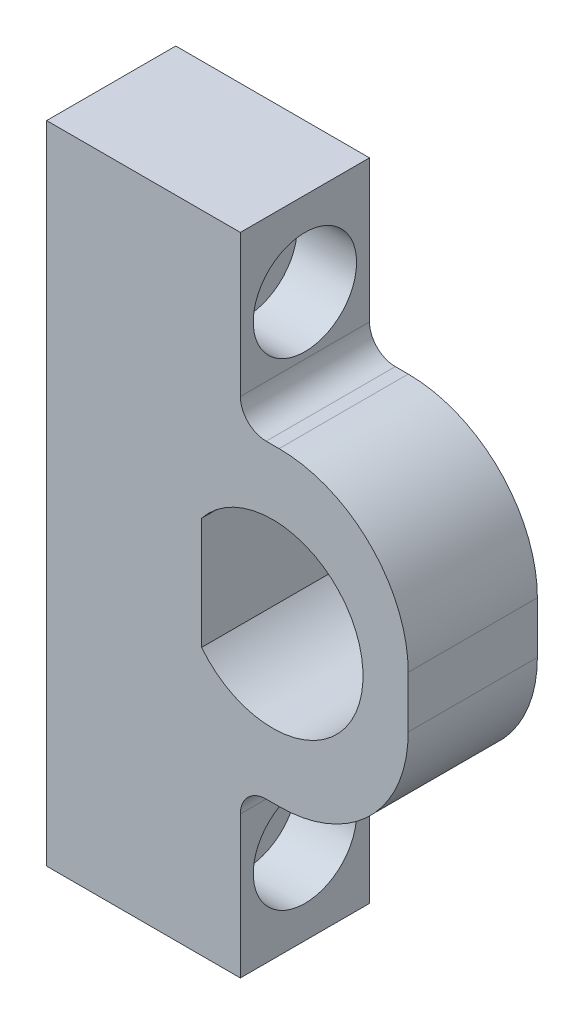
ISO-10303-21;
HEADER;
FILE_DESCRIPTION(('STEP AP214'),'2;1');
FILE_NAME('part.step','',(''),(''),'','','');
FILE_SCHEMA(('AUTOMOTIVE_DESIGN { 1 0 10303 214 1 1 1 1 }'));
ENDSEC;
DATA;
#1=APPLICATION_CONTEXT('core data for automotive mechanical design processes');
#2=APPLICATION_PROTOCOL_DEFINITION('international standard','automotive_design',2000,#1);
#3=PRODUCT_CONTEXT('',#1,'mechanical');
#4=PRODUCT('Part','Part','',(#3));
#5=PRODUCT_RELATED_PRODUCT_CATEGORY('part','',(#4));
#6=PRODUCT_DEFINITION_FORMATION('','',#4);
#7=PRODUCT_DEFINITION_CONTEXT('part definition',#1,'design');
#8=PRODUCT_DEFINITION('design','',#6,#7);
#9=PRODUCT_DEFINITION_SHAPE('','',#8);
#10=(LENGTH_UNIT() NAMED_UNIT(*) SI_UNIT(.MILLI.,.METRE.));
#11=(NAMED_UNIT(*) PLANE_ANGLE_UNIT() SI_UNIT($,.RADIAN.));
#12=(NAMED_UNIT(*) SI_UNIT($,.STERADIAN.) SOLID_ANGLE_UNIT());
#13=UNCERTAINTY_MEASURE_WITH_UNIT(LENGTH_MEASURE(1.E-05),#10,'distance_accuracy_value','');
#14=(GEOMETRIC_REPRESENTATION_CONTEXT(3) GLOBAL_UNCERTAINTY_ASSIGNED_CONTEXT((#13)) GLOBAL_UNIT_ASSIGNED_CONTEXT((#10,
#11,#12)) REPRESENTATION_CONTEXT('',''));
#15=CARTESIAN_POINT('',(0.,0.,0.));
#16=DIRECTION('',(0.,0.,1.));
#17=DIRECTION('',(1.,0.,0.));
#18=AXIS2_PLACEMENT_3D('',#15,#16,#17);
#19=CARTESIAN_POINT('',(14.,25.,10.));
#20=DIRECTION('',(-1.,0.,0.));
#21=DIRECTION('',(0.,-1.,0.));
#22=AXIS2_PLACEMENT_3D('',#19,#20,#21);
#23=PLANE('',#22);
#24=DIRECTION('',(0.,1.,0.));
#25=VECTOR('',#24,1.);
#26=CARTESIAN_POINT('',(14.,25.,10.));
#27=LINE('',#26,#25);
#28=CARTESIAN_POINT('',(14.,-2.,10.));
#29=VERTEX_POINT('',#28);
#30=CARTESIAN_POINT('',(14.,2.,10.));
#31=VERTEX_POINT('',#30);
#32=EDGE_CURVE('E175',#29,#31,#27,.T.);
#33=ORIENTED_EDGE('',*,*,#32,.F.);
#34=DIRECTION('',(0.,0.,-1.));
#35=VECTOR('',#34,1.);
#36=CARTESIAN_POINT('',(14.,-2.,10.));
#37=LINE('',#36,#35);
#38=CARTESIAN_POINT('',(14.,-2.,0.));
#39=VERTEX_POINT('',#38);
#40=EDGE_CURVE('E207',#29,#39,#37,.T.);
#41=ORIENTED_EDGE('',*,*,#40,.T.);
#42=DIRECTION('',(0.,1.,0.));
#43=VECTOR('',#42,1.);
#44=CARTESIAN_POINT('',(14.,25.,0.));
#45=LINE('',#44,#43);
#46=CARTESIAN_POINT('',(14.,2.,0.));
#47=VERTEX_POINT('',#46);
#48=EDGE_CURVE('E174',#39,#47,#45,.T.);
#49=ORIENTED_EDGE('',*,*,#48,.T.);
#50=DIRECTION('',(0.,0.,1.));
#51=VECTOR('',#50,1.);
#52=CARTESIAN_POINT('',(14.,2.,10.));
#53=LINE('',#52,#51);
#54=EDGE_CURVE('E204',#47,#31,#53,.T.);
#55=ORIENTED_EDGE('',*,*,#54,.T.);
#56=EDGE_LOOP('',(#33,#41,#49,#55));
#57=FACE_BOUND('',#56,.T.);
#58=ADVANCED_FACE('F16',(#57),#23,.F.);
#59=CARTESIAN_POINT('',(-14.,25.,10.));
#60=DIRECTION('',(0.,-1.,0.));
#61=DIRECTION('',(0.,0.,-1.));
#62=AXIS2_PLACEMENT_3D('',#59,#60,#61);
#63=PLANE('',#62);
#64=DIRECTION('',(-1.,0.,0.));
#65=VECTOR('',#64,1.);
#66=CARTESIAN_POINT('',(-14.,25.,10.));
#67=LINE('',#66,#65);
#68=CARTESIAN_POINT('',(1.,25.,10.));
#69=VERTEX_POINT('',#68);
#70=CARTESIAN_POINT('',(-14.,25.,10.));
#71=VERTEX_POINT('',#70);
#72=EDGE_CURVE('E178',#69,#71,#67,.T.);
#73=ORIENTED_EDGE('',*,*,#72,.F.);
#74=DIRECTION('',(0.,0.,-1.));
#75=VECTOR('',#74,1.);
#76=CARTESIAN_POINT('',(1.,25.,10.));
#77=LINE('',#76,#75);
#78=CARTESIAN_POINT('',(1.,25.,0.));
#79=VERTEX_POINT('',#78);
#80=EDGE_CURVE('E160',#69,#79,#77,.T.);
#81=ORIENTED_EDGE('',*,*,#80,.T.);
#82=DIRECTION('',(-1.,0.,0.));
#83=VECTOR('',#82,1.);
#84=CARTESIAN_POINT('',(-14.,25.,0.));
#85=LINE('',#84,#83);
#86=CARTESIAN_POINT('',(-14.,25.,0.));
#87=VERTEX_POINT('',#86);
#88=EDGE_CURVE('E189',#79,#87,#85,.T.);
#89=ORIENTED_EDGE('',*,*,#88,.T.);
#90=DIRECTION('',(0.,0.,-1.));
#91=VECTOR('',#90,1.);
#92=CARTESIAN_POINT('',(-14.,25.,10.));
#93=LINE('',#92,#91);
#94=EDGE_CURVE('E197',#71,#87,#93,.T.);
#95=ORIENTED_EDGE('',*,*,#94,.F.);
#96=EDGE_LOOP('',(#73,#81,#89,#95));
#97=FACE_BOUND('',#96,.T.);
#98=ADVANCED_FACE('F295',(#97),#63,.F.);
#99=CARTESIAN_POINT('',(-14.,25.,10.));
#100=DIRECTION('',(1.,0.,0.));
#101=DIRECTION('',(0.,1.,0.));
#102=AXIS2_PLACEMENT_3D('',#99,#100,#101);
#103=PLANE('',#102);
#104=CARTESIAN_POINT('',(-14.0000000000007,18.5,5.));
#105=DIRECTION('',(1.,0.,0.));
#106=DIRECTION('',(0.,0.,-1.));
#107=AXIS2_PLACEMENT_3D('',#104,#105,#106);
#108=CIRCLE('',#107,2.25);
#109=CARTESIAN_POINT('',(-14.0000000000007,18.5,2.75));
#110=VERTEX_POINT('',#109);
#111=EDGE_CURVE('E139',#110,#110,#108,.T.);
#112=ORIENTED_EDGE('',*,*,#111,.T.);
#113=EDGE_LOOP('',(#112));
#114=FACE_BOUND('',#113,.T.);
#115=CARTESIAN_POINT('',(-14.0000000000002,-18.5,5.));
#116=DIRECTION('',(1.,0.,0.));
#117=DIRECTION('',(0.,0.,-1.));
#118=AXIS2_PLACEMENT_3D('',#115,#116,#117);
#119=CIRCLE('',#118,2.25);
#120=CARTESIAN_POINT('',(-14.0000000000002,-18.5,2.75));
#121=VERTEX_POINT('',#120);
#122=EDGE_CURVE('E151',#121,#121,#119,.T.);
#123=ORIENTED_EDGE('',*,*,#122,.T.);
#124=EDGE_LOOP('',(#123));
#125=FACE_BOUND('',#124,.T.);
#126=DIRECTION('',(0.,-1.,0.));
#127=VECTOR('',#126,1.);
#128=CARTESIAN_POINT('',(-14.,25.,0.));
#129=LINE('',#128,#127);
#130=CARTESIAN_POINT('',(-14.,-25.,0.));
#131=VERTEX_POINT('',#130);
#132=EDGE_CURVE('E191',#87,#131,#129,.T.);
#133=ORIENTED_EDGE('',*,*,#132,.T.);
#134=DIRECTION('',(0.,0.,-1.));
#135=VECTOR('',#134,1.);
#136=CARTESIAN_POINT('',(-14.,-25.,10.));
#137=LINE('',#136,#135);
#138=CARTESIAN_POINT('',(-14.,-25.,10.));
#139=VERTEX_POINT('',#138);
#140=EDGE_CURVE('E186',#139,#131,#137,.T.);
#141=ORIENTED_EDGE('',*,*,#140,.F.);
#142=DIRECTION('',(0.,-1.,0.));
#143=VECTOR('',#142,1.);
#144=CARTESIAN_POINT('',(-14.,25.,10.));
#145=LINE('',#144,#143);
#146=EDGE_CURVE('E181',#71,#139,#145,.T.);
#147=ORIENTED_EDGE('',*,*,#146,.F.);
#148=ORIENTED_EDGE('',*,*,#94,.T.);
#149=EDGE_LOOP('',(#133,#141,#147,#148));
#150=FACE_BOUND('',#149,.T.);
#151=ADVANCED_FACE('F292',(#114,#125,#150),#103,.F.);
#152=CARTESIAN_POINT('',(-14.,-25.,10.));
#153=DIRECTION('',(0.,1.,0.));
#154=DIRECTION('',(0.,0.,1.));
#155=AXIS2_PLACEMENT_3D('',#152,#153,#154);
#156=PLANE('',#155);
#157=DIRECTION('',(1.,0.,0.));
#158=VECTOR('',#157,1.);
#159=CARTESIAN_POINT('',(-14.,-25.,0.));
#160=LINE('',#159,#158);
#161=CARTESIAN_POINT('',(1.,-25.,0.));
#162=VERTEX_POINT('',#161);
#163=EDGE_CURVE('E179',#131,#162,#160,.T.);
#164=ORIENTED_EDGE('',*,*,#163,.T.);
#165=DIRECTION('',(0.,0.,1.));
#166=VECTOR('',#165,1.);
#167=CARTESIAN_POINT('',(1.,-25.,10.));
#168=LINE('',#167,#166);
#169=CARTESIAN_POINT('',(1.,-25.,10.));
#170=VERTEX_POINT('',#169);
#171=EDGE_CURVE('E170',#162,#170,#168,.T.);
#172=ORIENTED_EDGE('',*,*,#171,.T.);
#173=DIRECTION('',(1.,0.,0.));
#174=VECTOR('',#173,1.);
#175=CARTESIAN_POINT('',(-14.,-25.,10.));
#176=LINE('',#175,#174);
#177=EDGE_CURVE('E183',#139,#170,#176,.T.);
#178=ORIENTED_EDGE('',*,*,#177,.F.);
#179=ORIENTED_EDGE('',*,*,#140,.T.);
#180=EDGE_LOOP('',(#164,#172,#178,#179));
#181=FACE_BOUND('',#180,.T.);
#182=ADVANCED_FACE('F288',(#181),#156,.F.);
#183=CARTESIAN_POINT('',(0.,0.,10.));
#184=DIRECTION('',(0.,0.,1.));
#185=DIRECTION('',(1.,0.,0.));
#186=AXIS2_PLACEMENT_3D('',#183,#184,#185);
#187=PLANE('',#186);
#188=CARTESIAN_POINT('',(3.5,0.,10.));
#189=DIRECTION('',(0.,0.,1.));
#190=DIRECTION('',(1.,0.,0.));
#191=AXIS2_PLACEMENT_3D('',#188,#189,#190);
#192=CIRCLE('',#191,7.);
#193=CARTESIAN_POINT('',(-2.,-4.3301270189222,10.));
#194=VERTEX_POINT('',#193);
#195=CARTESIAN_POINT('',(-2.,4.3301270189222,10.));
#196=VERTEX_POINT('',#195);
#197=EDGE_CURVE('E30',#194,#196,#192,.T.);
#198=ORIENTED_EDGE('',*,*,#197,.F.);
#199=DIRECTION('',(0.,1.,0.));
#200=VECTOR('',#199,1.);
#201=CARTESIAN_POINT('',(-2.,-5.,10.));
#202=LINE('',#201,#200);
#203=EDGE_CURVE('E117',#194,#196,#202,.T.);
#204=ORIENTED_EDGE('',*,*,#203,.T.);
#205=EDGE_LOOP('',(#198,#204));
#206=FACE_BOUND('',#205,.T.);
#207=DIRECTION('',(0.,1.,0.));
#208=VECTOR('',#207,1.);
#209=CARTESIAN_POINT('',(1.,-38.,10.));
#210=LINE('',#209,#208);
#211=CARTESIAN_POINT('',(1.,-14.,10.));
#212=VERTEX_POINT('',#211);
#213=EDGE_CURVE('E165',#170,#212,#210,.T.);
#214=ORIENTED_EDGE('',*,*,#213,.T.);
#215=CARTESIAN_POINT('',(3.,-14.,10.));
#216=DIRECTION('',(0.,0.,1.));
#217=DIRECTION('',(1.,0.,0.));
#218=AXIS2_PLACEMENT_3D('',#215,#216,#217);
#219=CIRCLE('',#218,2.);
#220=CARTESIAN_POINT('',(3.,-12.,10.));
#221=VERTEX_POINT('',#220);
#222=EDGE_CURVE('E237',#212,#221,#219,.F.);
#223=ORIENTED_EDGE('',*,*,#222,.T.);
#224=DIRECTION('',(1.,0.,0.));
#225=VECTOR('',#224,1.);
#226=CARTESIAN_POINT('',(27.,-12.,10.));
#227=LINE('',#226,#225);
#228=CARTESIAN_POINT('',(4.,-12.,10.));
#229=VERTEX_POINT('',#228);
#230=EDGE_CURVE('E168',#221,#229,#227,.T.);
#231=ORIENTED_EDGE('',*,*,#230,.T.);
#232=CARTESIAN_POINT('',(4.,-2.,10.));
#233=DIRECTION('',(0.,0.,1.));
#234=DIRECTION('',(1.,0.,0.));
#235=AXIS2_PLACEMENT_3D('',#232,#233,#234);
#236=CIRCLE('',#235,10.);
#237=EDGE_CURVE('E220',#229,#29,#236,.T.);
#238=ORIENTED_EDGE('',*,*,#237,.T.);
#239=ORIENTED_EDGE('',*,*,#32,.T.);
#240=CARTESIAN_POINT('',(4.,2.,10.));
#241=DIRECTION('',(0.,0.,1.));
#242=DIRECTION('',(1.,0.,0.));
#243=AXIS2_PLACEMENT_3D('',#240,#241,#242);
#244=CIRCLE('',#243,10.);
#245=CARTESIAN_POINT('',(4.,12.,10.));
#246=VERTEX_POINT('',#245);
#247=EDGE_CURVE('E218',#31,#246,#244,.T.);
#248=ORIENTED_EDGE('',*,*,#247,.T.);
#249=DIRECTION('',(-1.,0.,0.));
#250=VECTOR('',#249,1.);
#251=CARTESIAN_POINT('',(27.,12.,10.));
#252=LINE('',#251,#250);
#253=CARTESIAN_POINT('',(3.,12.,10.));
#254=VERTEX_POINT('',#253);
#255=EDGE_CURVE('E155',#246,#254,#252,.T.);
#256=ORIENTED_EDGE('',*,*,#255,.T.);
#257=CARTESIAN_POINT('',(3.,14.,10.));
#258=DIRECTION('',(0.,0.,1.));
#259=DIRECTION('',(1.,0.,0.));
#260=AXIS2_PLACEMENT_3D('',#257,#258,#259);
#261=CIRCLE('',#260,2.);
#262=CARTESIAN_POINT('',(1.,14.,10.));
#263=VERTEX_POINT('',#262);
#264=EDGE_CURVE('E124',#254,#263,#261,.F.);
#265=ORIENTED_EDGE('',*,*,#264,.T.);
#266=DIRECTION('',(0.,1.,0.));
#267=VECTOR('',#266,1.);
#268=CARTESIAN_POINT('',(1.,38.,10.));
#269=LINE('',#268,#267);
#270=EDGE_CURVE('E158',#263,#69,#269,.T.);
#271=ORIENTED_EDGE('',*,*,#270,.T.);
#272=ORIENTED_EDGE('',*,*,#72,.T.);
#273=ORIENTED_EDGE('',*,*,#146,.T.);
#274=ORIENTED_EDGE('',*,*,#177,.T.);
#275=EDGE_LOOP('',(#214,#223,#231,#238,#239,#248,#256,#265,#271,#272,#273,#274));
#276=FACE_BOUND('',#275,.T.);
#277=ADVANCED_FACE('F114',(#206,#276),#187,.T.);
#278=CARTESIAN_POINT('',(0.,0.,0.));
#279=DIRECTION('',(0.,0.,1.));
#280=DIRECTION('',(1.,0.,0.));
#281=AXIS2_PLACEMENT_3D('',#278,#279,#280);
#282=PLANE('',#281);
#283=DIRECTION('',(0.,1.,0.));
#284=VECTOR('',#283,1.);
#285=CARTESIAN_POINT('',(-2.,-5.,0.));
#286=LINE('',#285,#284);
#287=CARTESIAN_POINT('',(-2.,-4.3301270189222,0.));
#288=VERTEX_POINT('',#287);
#289=CARTESIAN_POINT('',(-2.,4.3301270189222,0.));
#290=VERTEX_POINT('',#289);
#291=EDGE_CURVE('E118',#288,#290,#286,.T.);
#292=ORIENTED_EDGE('',*,*,#291,.F.);
#293=CARTESIAN_POINT('',(3.5,0.,0.));
#294=DIRECTION('',(0.,0.,1.));
#295=DIRECTION('',(1.,0.,0.));
#296=AXIS2_PLACEMENT_3D('',#293,#294,#295);
#297=CIRCLE('',#296,7.);
#298=EDGE_CURVE('E35',#288,#290,#297,.T.);
#299=ORIENTED_EDGE('',*,*,#298,.T.);
#300=EDGE_LOOP('',(#292,#299));
#301=FACE_BOUND('',#300,.T.);
#302=ORIENTED_EDGE('',*,*,#48,.F.);
#303=CARTESIAN_POINT('',(4.,-2.,0.));
#304=DIRECTION('',(0.,0.,1.));
#305=DIRECTION('',(1.,0.,0.));
#306=AXIS2_PLACEMENT_3D('',#303,#304,#305);
#307=CIRCLE('',#306,10.);
#308=CARTESIAN_POINT('',(4.,-12.,0.));
#309=VERTEX_POINT('',#308);
#310=EDGE_CURVE('E212',#39,#309,#307,.F.);
#311=ORIENTED_EDGE('',*,*,#310,.T.);
#312=DIRECTION('',(1.,0.,0.));
#313=VECTOR('',#312,1.);
#314=CARTESIAN_POINT('',(27.,-12.,0.));
#315=LINE('',#314,#313);
#316=CARTESIAN_POINT('',(3.,-12.,0.));
#317=VERTEX_POINT('',#316);
#318=EDGE_CURVE('E164',#317,#309,#315,.T.);
#319=ORIENTED_EDGE('',*,*,#318,.F.);
#320=CARTESIAN_POINT('',(3.,-14.,0.));
#321=DIRECTION('',(0.,0.,1.));
#322=DIRECTION('',(1.,0.,0.));
#323=AXIS2_PLACEMENT_3D('',#320,#321,#322);
#324=CIRCLE('',#323,2.);
#325=CARTESIAN_POINT('',(1.,-14.,0.));
#326=VERTEX_POINT('',#325);
#327=EDGE_CURVE('E235',#317,#326,#324,.T.);
#328=ORIENTED_EDGE('',*,*,#327,.T.);
#329=DIRECTION('',(0.,-1.,0.));
#330=VECTOR('',#329,1.);
#331=CARTESIAN_POINT('',(1.,0.,0.));
#332=LINE('',#331,#330);
#333=EDGE_CURVE('E200',#326,#162,#332,.T.);
#334=ORIENTED_EDGE('',*,*,#333,.T.);
#335=ORIENTED_EDGE('',*,*,#163,.F.);
#336=ORIENTED_EDGE('',*,*,#132,.F.);
#337=ORIENTED_EDGE('',*,*,#88,.F.);
#338=DIRECTION('',(0.,1.,0.));
#339=VECTOR('',#338,1.);
#340=CARTESIAN_POINT('',(1.,38.,0.));
#341=LINE('',#340,#339);
#342=CARTESIAN_POINT('',(1.,14.,0.));
#343=VERTEX_POINT('',#342);
#344=EDGE_CURVE('E154',#343,#79,#341,.T.);
#345=ORIENTED_EDGE('',*,*,#344,.F.);
#346=CARTESIAN_POINT('',(3.,14.,0.));
#347=DIRECTION('',(0.,0.,1.));
#348=DIRECTION('',(1.,0.,0.));
#349=AXIS2_PLACEMENT_3D('',#346,#347,#348);
#350=CIRCLE('',#349,2.);
#351=CARTESIAN_POINT('',(3.,12.,0.));
#352=VERTEX_POINT('',#351);
#353=EDGE_CURVE('E239',#343,#352,#350,.T.);
#354=ORIENTED_EDGE('',*,*,#353,.T.);
#355=DIRECTION('',(1.,0.,0.));
#356=VECTOR('',#355,1.);
#357=CARTESIAN_POINT('',(0.,12.,0.));
#358=LINE('',#357,#356);
#359=CARTESIAN_POINT('',(4.,12.,0.));
#360=VERTEX_POINT('',#359);
#361=EDGE_CURVE('E202',#352,#360,#358,.T.);
#362=ORIENTED_EDGE('',*,*,#361,.T.);
#363=CARTESIAN_POINT('',(4.,2.,0.));
#364=DIRECTION('',(0.,0.,1.));
#365=DIRECTION('',(1.,0.,0.));
#366=AXIS2_PLACEMENT_3D('',#363,#364,#365);
#367=CIRCLE('',#366,10.);
#368=EDGE_CURVE('E210',#360,#47,#367,.F.);
#369=ORIENTED_EDGE('',*,*,#368,.T.);
#370=EDGE_LOOP('',(#302,#311,#319,#328,#334,#335,#336,#337,#345,#354,#362,#369));
#371=FACE_BOUND('',#370,.T.);
#372=ADVANCED_FACE('F255',(#301,#371),#282,.F.);
#373=CARTESIAN_POINT('',(1.,-38.,10.));
#374=DIRECTION('',(-1.,0.,0.));
#375=DIRECTION('',(0.,0.,1.));
#376=AXIS2_PLACEMENT_3D('',#373,#374,#375);
#377=PLANE('',#376);
#378=CARTESIAN_POINT('',(1.00000000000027,-18.5,5.));
#379=DIRECTION('',(1.,0.,0.));
#380=DIRECTION('',(0.,0.,-1.));
#381=AXIS2_PLACEMENT_3D('',#378,#379,#380);
#382=CIRCLE('',#381,4.);
#383=CARTESIAN_POINT('',(1.00000000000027,-18.5,1.));
#384=VERTEX_POINT('',#383);
#385=EDGE_CURVE('E142',#384,#384,#382,.T.);
#386=ORIENTED_EDGE('',*,*,#385,.F.);
#387=EDGE_LOOP('',(#386));
#388=FACE_BOUND('',#387,.T.);
#389=ORIENTED_EDGE('',*,*,#333,.F.);
#390=DIRECTION('',(0.,0.,-1.));
#391=VECTOR('',#390,1.);
#392=CARTESIAN_POINT('',(1.,-14.,10.));
#393=LINE('',#392,#391);
#394=EDGE_CURVE('E228',#326,#212,#393,.F.);
#395=ORIENTED_EDGE('',*,*,#394,.T.);
#396=ORIENTED_EDGE('',*,*,#213,.F.);
#397=ORIENTED_EDGE('',*,*,#171,.F.);
#398=EDGE_LOOP('',(#389,#395,#396,#397));
#399=FACE_BOUND('',#398,.T.);
#400=ADVANCED_FACE('F282',(#388,#399),#377,.F.);
#401=CARTESIAN_POINT('',(27.,-12.,10.));
#402=DIRECTION('',(0.,1.,0.));
#403=DIRECTION('',(0.,0.,1.));
#404=AXIS2_PLACEMENT_3D('',#401,#402,#403);
#405=PLANE('',#404);
#406=ORIENTED_EDGE('',*,*,#230,.F.);
#407=DIRECTION('',(0.,0.,-1.));
#408=VECTOR('',#407,1.);
#409=CARTESIAN_POINT('',(3.,-12.,0.));
#410=LINE('',#409,#408);
#411=EDGE_CURVE('E225',#221,#317,#410,.T.);
#412=ORIENTED_EDGE('',*,*,#411,.T.);
#413=ORIENTED_EDGE('',*,*,#318,.T.);
#414=DIRECTION('',(0.,0.,-1.));
#415=VECTOR('',#414,1.);
#416=CARTESIAN_POINT('',(4.,-12.,10.));
#417=LINE('',#416,#415);
#418=EDGE_CURVE('E215',#309,#229,#417,.F.);
#419=ORIENTED_EDGE('',*,*,#418,.T.);
#420=EDGE_LOOP('',(#406,#412,#413,#419));
#421=FACE_BOUND('',#420,.T.);
#422=ADVANCED_FACE('F275',(#421),#405,.F.);
#423=CARTESIAN_POINT('',(1.,38.,10.));
#424=DIRECTION('',(-1.,0.,0.));
#425=DIRECTION('',(0.,0.,1.));
#426=AXIS2_PLACEMENT_3D('',#423,#424,#425);
#427=PLANE('',#426);
#428=CARTESIAN_POINT('',(0.999999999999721,18.5,5.));
#429=DIRECTION('',(1.,0.,0.));
#430=DIRECTION('',(0.,0.,-1.));
#431=AXIS2_PLACEMENT_3D('',#428,#429,#430);
#432=CIRCLE('',#431,4.);
#433=CARTESIAN_POINT('',(0.999999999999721,18.5,1.));
#434=VERTEX_POINT('',#433);
#435=EDGE_CURVE('E130',#434,#434,#432,.T.);
#436=ORIENTED_EDGE('',*,*,#435,.F.);
#437=EDGE_LOOP('',(#436));
#438=FACE_BOUND('',#437,.T.);
#439=ORIENTED_EDGE('',*,*,#270,.F.);
#440=DIRECTION('',(0.,0.,-1.));
#441=VECTOR('',#440,1.);
#442=CARTESIAN_POINT('',(1.,14.,0.));
#443=LINE('',#442,#441);
#444=EDGE_CURVE('E230',#263,#343,#443,.T.);
#445=ORIENTED_EDGE('',*,*,#444,.T.);
#446=ORIENTED_EDGE('',*,*,#344,.T.);
#447=ORIENTED_EDGE('',*,*,#80,.F.);
#448=EDGE_LOOP('',(#439,#445,#446,#447));
#449=FACE_BOUND('',#448,.T.);
#450=ADVANCED_FACE('F249',(#438,#449),#427,.F.);
#451=CARTESIAN_POINT('',(27.,12.,10.));
#452=DIRECTION('',(0.,-1.,0.));
#453=DIRECTION('',(0.,0.,-1.));
#454=AXIS2_PLACEMENT_3D('',#451,#452,#453);
#455=PLANE('',#454);
#456=ORIENTED_EDGE('',*,*,#361,.F.);
#457=DIRECTION('',(0.,0.,-1.));
#458=VECTOR('',#457,1.);
#459=CARTESIAN_POINT('',(3.,12.,10.));
#460=LINE('',#459,#458);
#461=EDGE_CURVE('E233',#352,#254,#460,.F.);
#462=ORIENTED_EDGE('',*,*,#461,.T.);
#463=ORIENTED_EDGE('',*,*,#255,.F.);
#464=DIRECTION('',(0.,0.,1.));
#465=VECTOR('',#464,1.);
#466=CARTESIAN_POINT('',(4.,12.,10.));
#467=LINE('',#466,#465);
#468=EDGE_CURVE('E222',#246,#360,#467,.F.);
#469=ORIENTED_EDGE('',*,*,#468,.T.);
#470=EDGE_LOOP('',(#456,#462,#463,#469));
#471=FACE_BOUND('',#470,.T.);
#472=ADVANCED_FACE('F258',(#471),#455,.F.);
#473=CARTESIAN_POINT('',(1.00000000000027,-18.5,5.));
#474=DIRECTION('',(1.,0.,0.));
#475=DIRECTION('',(0.,0.,-1.));
#476=AXIS2_PLACEMENT_3D('',#473,#474,#475);
#477=CYLINDRICAL_SURFACE('',#476,2.25);
#478=ORIENTED_EDGE('',*,*,#122,.F.);
#479=EDGE_LOOP('',(#478));
#480=FACE_BOUND('',#479,.T.);
#481=CARTESIAN_POINT('',(-3.59999999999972,-18.5,5.));
#482=DIRECTION('',(1.,0.,0.));
#483=DIRECTION('',(0.,0.,-1.));
#484=AXIS2_PLACEMENT_3D('',#481,#482,#483);
#485=CIRCLE('',#484,2.25);
#486=CARTESIAN_POINT('',(-3.59999999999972,-18.5,2.75));
#487=VERTEX_POINT('',#486);
#488=EDGE_CURVE('E148',#487,#487,#485,.T.);
#489=ORIENTED_EDGE('',*,*,#488,.T.);
#490=EDGE_LOOP('',(#489));
#491=FACE_BOUND('',#490,.T.);
#492=ADVANCED_FACE('F347',(#480,#491),#477,.F.);
#493=CARTESIAN_POINT('',(-3.59999999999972,-16.25,5.));
#494=DIRECTION('',(-1.,0.,0.));
#495=DIRECTION('',(0.,0.,1.));
#496=AXIS2_PLACEMENT_3D('',#493,#494,#495);
#497=PLANE('',#496);
#498=ORIENTED_EDGE('',*,*,#488,.F.);
#499=EDGE_LOOP('',(#498));
#500=FACE_BOUND('',#499,.T.);
#501=CARTESIAN_POINT('',(-3.59999999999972,-18.5,5.));
#502=DIRECTION('',(1.,0.,0.));
#503=DIRECTION('',(0.,0.,-1.));
#504=AXIS2_PLACEMENT_3D('',#501,#502,#503);
#505=CIRCLE('',#504,4.);
#506=CARTESIAN_POINT('',(-3.59999999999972,-18.5,1.));
#507=VERTEX_POINT('',#506);
#508=EDGE_CURVE('E145',#507,#507,#505,.T.);
#509=ORIENTED_EDGE('',*,*,#508,.T.);
#510=EDGE_LOOP('',(#509));
#511=FACE_BOUND('',#510,.T.);
#512=ADVANCED_FACE('F343',(#500,#511),#497,.F.);
#513=CARTESIAN_POINT('',(1.00000000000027,-18.5,5.));
#514=DIRECTION('',(1.,0.,0.));
#515=DIRECTION('',(0.,0.,-1.));
#516=AXIS2_PLACEMENT_3D('',#513,#514,#515);
#517=CYLINDRICAL_SURFACE('',#516,4.);
#518=ORIENTED_EDGE('',*,*,#508,.F.);
#519=EDGE_LOOP('',(#518));
#520=FACE_BOUND('',#519,.T.);
#521=ORIENTED_EDGE('',*,*,#385,.T.);
#522=EDGE_LOOP('',(#521));
#523=FACE_BOUND('',#522,.T.);
#524=ADVANCED_FACE('F339',(#520,#523),#517,.F.);
#525=CARTESIAN_POINT('',(0.999999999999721,18.5,5.));
#526=DIRECTION('',(1.,0.,0.));
#527=DIRECTION('',(0.,0.,-1.));
#528=AXIS2_PLACEMENT_3D('',#525,#526,#527);
#529=CYLINDRICAL_SURFACE('',#528,2.25);
#530=ORIENTED_EDGE('',*,*,#111,.F.);
#531=EDGE_LOOP('',(#530));
#532=FACE_BOUND('',#531,.T.);
#533=CARTESIAN_POINT('',(-3.60000000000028,18.5,5.));
#534=DIRECTION('',(1.,0.,0.));
#535=DIRECTION('',(0.,0.,-1.));
#536=AXIS2_PLACEMENT_3D('',#533,#534,#535);
#537=CIRCLE('',#536,2.25);
#538=CARTESIAN_POINT('',(-3.60000000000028,18.5,2.75));
#539=VERTEX_POINT('',#538);
#540=EDGE_CURVE('E136',#539,#539,#537,.T.);
#541=ORIENTED_EDGE('',*,*,#540,.T.);
#542=EDGE_LOOP('',(#541));
#543=FACE_BOUND('',#542,.T.);
#544=ADVANCED_FACE('F335',(#532,#543),#529,.F.);
#545=CARTESIAN_POINT('',(-3.60000000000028,20.75,5.));
#546=DIRECTION('',(-1.,0.,0.));
#547=DIRECTION('',(0.,0.,1.));
#548=AXIS2_PLACEMENT_3D('',#545,#546,#547);
#549=PLANE('',#548);
#550=ORIENTED_EDGE('',*,*,#540,.F.);
#551=EDGE_LOOP('',(#550));
#552=FACE_BOUND('',#551,.T.);
#553=CARTESIAN_POINT('',(-3.60000000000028,18.5,5.));
#554=DIRECTION('',(1.,0.,0.));
#555=DIRECTION('',(0.,0.,-1.));
#556=AXIS2_PLACEMENT_3D('',#553,#554,#555);
#557=CIRCLE('',#556,4.);
#558=CARTESIAN_POINT('',(-3.60000000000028,18.5,1.));
#559=VERTEX_POINT('',#558);
#560=EDGE_CURVE('E133',#559,#559,#557,.T.);
#561=ORIENTED_EDGE('',*,*,#560,.T.);
#562=EDGE_LOOP('',(#561));
#563=FACE_BOUND('',#562,.T.);
#564=ADVANCED_FACE('F331',(#552,#563),#549,.F.);
#565=CARTESIAN_POINT('',(0.999999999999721,18.5,5.));
#566=DIRECTION('',(1.,0.,0.));
#567=DIRECTION('',(0.,0.,-1.));
#568=AXIS2_PLACEMENT_3D('',#565,#566,#567);
#569=CYLINDRICAL_SURFACE('',#568,4.);
#570=ORIENTED_EDGE('',*,*,#560,.F.);
#571=EDGE_LOOP('',(#570));
#572=FACE_BOUND('',#571,.T.);
#573=ORIENTED_EDGE('',*,*,#435,.T.);
#574=EDGE_LOOP('',(#573));
#575=FACE_BOUND('',#574,.T.);
#576=ADVANCED_FACE('F328',(#572,#575),#569,.F.);
#577=CARTESIAN_POINT('',(3.5,0.,10.));
#578=DIRECTION('',(0.,0.,1.));
#579=DIRECTION('',(1.,0.,0.));
#580=AXIS2_PLACEMENT_3D('',#577,#578,#579);
#581=CYLINDRICAL_SURFACE('',#580,7.);
#582=ORIENTED_EDGE('',*,*,#197,.T.);
#583=DIRECTION('',(0.,0.,1.));
#584=VECTOR('',#583,1.);
#585=CARTESIAN_POINT('',(-2.,4.3301270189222,10.));
#586=LINE('',#585,#584);
#587=EDGE_CURVE('E11',#196,#290,#586,.F.);
#588=ORIENTED_EDGE('',*,*,#587,.T.);
#589=ORIENTED_EDGE('',*,*,#298,.F.);
#590=DIRECTION('',(0.,0.,1.));
#591=VECTOR('',#590,1.);
#592=CARTESIAN_POINT('',(-2.,-4.3301270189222,10.));
#593=LINE('',#592,#591);
#594=EDGE_CURVE('E24',#288,#194,#593,.T.);
#595=ORIENTED_EDGE('',*,*,#594,.T.);
#596=EDGE_LOOP('',(#582,#588,#589,#595));
#597=FACE_BOUND('',#596,.T.);
#598=ADVANCED_FACE('F120',(#597),#581,.F.);
#599=CARTESIAN_POINT('',(4.,-2.,10.));
#600=DIRECTION('',(0.,0.,-1.));
#601=DIRECTION('',(-1.,0.,0.));
#602=AXIS2_PLACEMENT_3D('',#599,#600,#601);
#603=CYLINDRICAL_SURFACE('',#602,10.);
#604=ORIENTED_EDGE('',*,*,#237,.F.);
#605=ORIENTED_EDGE('',*,*,#418,.F.);
#606=ORIENTED_EDGE('',*,*,#310,.F.);
#607=ORIENTED_EDGE('',*,*,#40,.F.);
#608=EDGE_LOOP('',(#604,#605,#606,#607));
#609=FACE_BOUND('',#608,.T.);
#610=ADVANCED_FACE('F269',(#609),#603,.T.);
#611=CARTESIAN_POINT('',(4.,2.,10.));
#612=DIRECTION('',(0.,0.,1.));
#613=DIRECTION('',(1.,0.,0.));
#614=AXIS2_PLACEMENT_3D('',#611,#612,#613);
#615=CYLINDRICAL_SURFACE('',#614,10.);
#616=ORIENTED_EDGE('',*,*,#368,.F.);
#617=ORIENTED_EDGE('',*,*,#468,.F.);
#618=ORIENTED_EDGE('',*,*,#247,.F.);
#619=ORIENTED_EDGE('',*,*,#54,.F.);
#620=EDGE_LOOP('',(#616,#617,#618,#619));
#621=FACE_BOUND('',#620,.T.);
#622=ADVANCED_FACE('F263',(#621),#615,.T.);
#623=CARTESIAN_POINT('',(3.,-14.,10.));
#624=DIRECTION('',(0.,0.,1.));
#625=DIRECTION('',(1.,0.,0.));
#626=AXIS2_PLACEMENT_3D('',#623,#624,#625);
#627=CYLINDRICAL_SURFACE('',#626,2.);
#628=ORIENTED_EDGE('',*,*,#222,.F.);
#629=ORIENTED_EDGE('',*,*,#394,.F.);
#630=ORIENTED_EDGE('',*,*,#327,.F.);
#631=ORIENTED_EDGE('',*,*,#411,.F.);
#632=EDGE_LOOP('',(#628,#629,#630,#631));
#633=FACE_BOUND('',#632,.T.);
#634=ADVANCED_FACE('F279',(#633),#627,.F.);
#635=CARTESIAN_POINT('',(3.,14.,10.));
#636=DIRECTION('',(0.,0.,1.));
#637=DIRECTION('',(1.,0.,0.));
#638=AXIS2_PLACEMENT_3D('',#635,#636,#637);
#639=CYLINDRICAL_SURFACE('',#638,2.);
#640=ORIENTED_EDGE('',*,*,#264,.F.);
#641=ORIENTED_EDGE('',*,*,#461,.F.);
#642=ORIENTED_EDGE('',*,*,#353,.F.);
#643=ORIENTED_EDGE('',*,*,#444,.F.);
#644=EDGE_LOOP('',(#640,#641,#642,#643));
#645=FACE_BOUND('',#644,.T.);
#646=ADVANCED_FACE('F18',(#645),#639,.F.);
#647=CARTESIAN_POINT('',(-2.,-5.,0.));
#648=DIRECTION('',(1.,0.,0.));
#649=DIRECTION('',(0.,0.,-1.));
#650=AXIS2_PLACEMENT_3D('',#647,#648,#649);
#651=PLANE('',#650);
#652=ORIENTED_EDGE('',*,*,#587,.F.);
#653=ORIENTED_EDGE('',*,*,#203,.F.);
#654=ORIENTED_EDGE('',*,*,#594,.F.);
#655=ORIENTED_EDGE('',*,*,#291,.T.);
#656=EDGE_LOOP('',(#652,#653,#654,#655));
#657=FACE_BOUND('',#656,.T.);
#658=ADVANCED_FACE('F125',(#657),#651,.T.);
#659=CLOSED_SHELL('',(#58,#98,#151,#182,#277,#372,#400,#422,#450,#472,#492,#512,#524,#544,#564,
#576,#598,#610,#622,#634,#646,#658));
#660=MANIFOLD_SOLID_BREP('B1',#659);
#661=ADVANCED_BREP_SHAPE_REPRESENTATION('',(#18,#660),#14);
#662=SHAPE_DEFINITION_REPRESENTATION(#9,#661);
ENDSEC;
END-ISO-10303-21;
